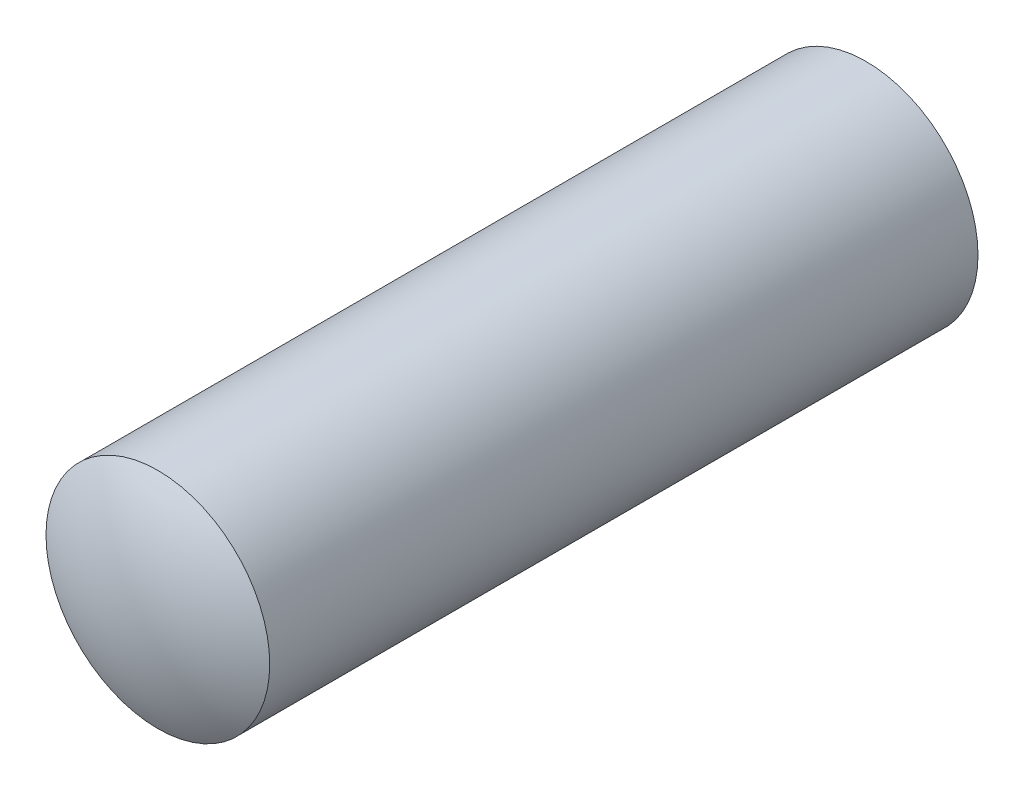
ISO-10303-21;
HEADER;
FILE_DESCRIPTION(('STEP AP214'),'2;1');
FILE_NAME('part.step','',(''),(''),'','','');
FILE_SCHEMA(('AUTOMOTIVE_DESIGN { 1 0 10303 214 1 1 1 1 }'));
ENDSEC;
DATA;
#1=APPLICATION_CONTEXT('core data for automotive mechanical design processes');
#2=APPLICATION_PROTOCOL_DEFINITION('international standard','automotive_design',2000,#1);
#3=PRODUCT_CONTEXT('',#1,'mechanical');
#4=PRODUCT('Part','Part','',(#3));
#5=PRODUCT_RELATED_PRODUCT_CATEGORY('part','',(#4));
#6=PRODUCT_DEFINITION_FORMATION('','',#4);
#7=PRODUCT_DEFINITION_CONTEXT('part definition',#1,'design');
#8=PRODUCT_DEFINITION('design','',#6,#7);
#9=PRODUCT_DEFINITION_SHAPE('','',#8);
#10=(LENGTH_UNIT() NAMED_UNIT(*) SI_UNIT(.MILLI.,.METRE.));
#11=(NAMED_UNIT(*) PLANE_ANGLE_UNIT() SI_UNIT($,.RADIAN.));
#12=(NAMED_UNIT(*) SI_UNIT($,.STERADIAN.) SOLID_ANGLE_UNIT());
#13=UNCERTAINTY_MEASURE_WITH_UNIT(LENGTH_MEASURE(1.E-05),#10,'distance_accuracy_value','');
#14=(GEOMETRIC_REPRESENTATION_CONTEXT(3) GLOBAL_UNCERTAINTY_ASSIGNED_CONTEXT((#13)) GLOBAL_UNIT_ASSIGNED_CONTEXT((#10,
#11,#12)) REPRESENTATION_CONTEXT('',''));
#15=CARTESIAN_POINT('',(0.,0.,0.));
#16=DIRECTION('',(0.,0.,1.));
#17=DIRECTION('',(1.,0.,0.));
#18=AXIS2_PLACEMENT_3D('',#15,#16,#17);
#19=CARTESIAN_POINT('',(0.,0.,11.5));
#20=DIRECTION('',(0.,0.,-1.));
#21=DIRECTION('',(1.,0.,0.));
#22=AXIS2_PLACEMENT_3D('',#19,#20,#21);
#23=SPHERICAL_SURFACE('',#22,5.);
#24=CARTESIAN_POINT('',(0.,0.,15.8301270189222));
#25=DIRECTION('',(0.,0.,-1.));
#26=DIRECTION('',(-1.,0.,0.));
#27=AXIS2_PLACEMENT_3D('',#24,#25,#26);
#28=CIRCLE('',#27,2.5);
#29=CARTESIAN_POINT('',(-2.5,0.,15.8301270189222));
#30=VERTEX_POINT('',#29);
#31=EDGE_CURVE('E9',#30,#30,#28,.T.);
#32=ORIENTED_EDGE('',*,*,#31,.F.);
#33=EDGE_LOOP('',(#32));
#34=FACE_BOUND('',#33,.T.);
#35=ADVANCED_FACE('F14',(#34),#23,.T.);
#36=CARTESIAN_POINT('',(0.,0.,-7.04993094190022));
#37=DIRECTION('',(0.,0.,-1.));
#38=DIRECTION('',(-1.,0.,0.));
#39=AXIS2_PLACEMENT_3D('',#36,#37,#38);
#40=CYLINDRICAL_SURFACE('',#39,2.5);
#41=ORIENTED_EDGE('',*,*,#31,.T.);
#42=EDGE_LOOP('',(#41));
#43=FACE_BOUND('',#42,.T.);
#44=CARTESIAN_POINT('',(0.,0.,0.));
#45=DIRECTION('',(0.,0.,1.));
#46=DIRECTION('',(1.,0.,0.));
#47=AXIS2_PLACEMENT_3D('',#44,#45,#46);
#48=CIRCLE('',#47,2.5);
#49=CARTESIAN_POINT('',(2.5,0.,0.));
#50=VERTEX_POINT('',#49);
#51=EDGE_CURVE('E20',#50,#50,#48,.T.);
#52=ORIENTED_EDGE('',*,*,#51,.T.);
#53=EDGE_LOOP('',(#52));
#54=FACE_BOUND('',#53,.T.);
#55=ADVANCED_FACE('F26',(#43,#54),#40,.T.);
#56=CARTESIAN_POINT('',(2.,0.,0.));
#57=DIRECTION('',(0.,0.,1.));
#58=DIRECTION('',(1.,0.,0.));
#59=AXIS2_PLACEMENT_3D('',#56,#57,#58);
#60=PLANE('',#59);
#61=ORIENTED_EDGE('',*,*,#51,.F.);
#62=EDGE_LOOP('',(#61));
#63=FACE_BOUND('',#62,.T.);
#64=ADVANCED_FACE('F28',(#63),#60,.F.);
#65=CLOSED_SHELL('',(#35,#55,#64));
#66=MANIFOLD_SOLID_BREP('B1',#65);
#67=ADVANCED_BREP_SHAPE_REPRESENTATION('',(#18,#66),#14);
#68=SHAPE_DEFINITION_REPRESENTATION(#9,#67);
ENDSEC;
END-ISO-10303-21;
